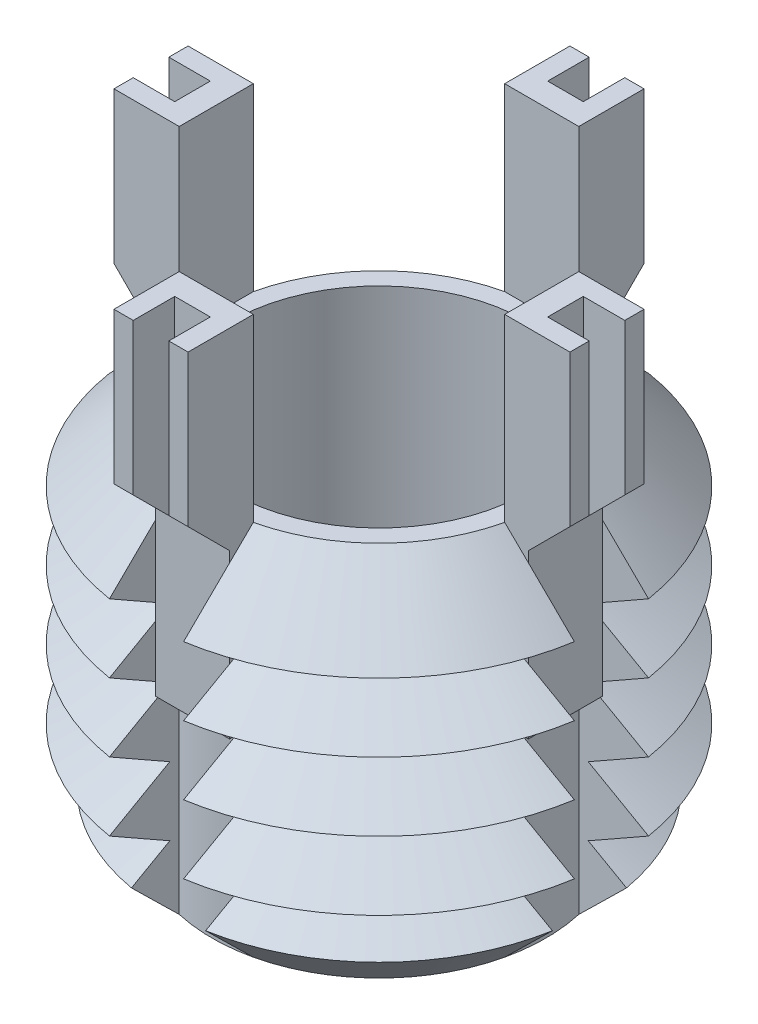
from build123d import *

# Parameters (mm, degrees)
SKETCH1_R           = 7.9375
BOSS_EXTRUDE1_DEPTH = 12.7
CHAMFER1_SIZE       = 2.309
LPATTERN1_COUNT     = 4
LPATTERN1_PITCH     = 2.309
CUT_EXTRUDE1_REACH  = 18.95
CIRPATTERN1_COUNT   = 4
BOSS_EXTRUDE3_DEPTH = 1.25
CIRPATTERN2_COUNT   = 4
CUT_EXTRUDE3_REACH  = 23.802
SKETCH6_W           = 1.4
SKETCH6_H           = 1.2
SKETCH6_W_2         = 1.2
SKETCH6_H_2         = 1.4
SKETCH7_R           = 5
CUT_EXTRUDE4_DEPTH  = 12.7


with BuildPart() as part:
    # Sketch1 → Boss-Extrude1 (new body)
    with BuildSketch(Plane(origin=(0, 0, 0), x_dir=(1, 0, 0), z_dir=(0, 1, 0))):
        with Locations(Location((0, 0, 0), (0, 0, 270))):
            Circle(SKETCH1_R)
    extrude(amount=-BOSS_EXTRUDE1_DEPTH)

    # Chamfer1
    chamfer1_edges = [part.edges().sort_by_distance(p)[0] for p in [
        (0, 0, -7.9375),
        (0, -12.7, -7.9375),
    ]]
    chamfer(chamfer1_edges, length=CHAMFER1_SIZE)

    # Sketch3 → Cut-Revolve1 (revolve, cut)
    with BuildSketch(Plane(origin=(0, 0, 0), x_dir=(0, 0, -1), z_dir=(1, 0, 0))):
        Polygon((-7.9375, -2.309), (-5.937847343, -3.4635), (-7.9375, -4.618), align=None)
    cut_revolve1 = revolve(axis=Axis((0, 0.885892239, 0), (0, -1, 0)), mode=Mode.SUBTRACT)

    # LPattern1: Cut-Revolve1 ×4
    with Locations(*[(0, -i * LPATTERN1_PITCH, 0) for i in range(1, LPATTERN1_COUNT)]):
        add(cut_revolve1, mode=Mode.SUBTRACT)

    # Cut-Extrude1: up to this cone (the profile starts inside it)
    cut_extrude1_end = Plane(origin=(0, 0, 0), z_dir=(0, 1, 0)).offset(-18.328499) * Cone(1e-06, 56.107, 56.106999, align=(Align.CENTER, Align.CENTER, Align.MIN), mode=Mode.PRIVATE)
    # Sketch4 → Cut-Extrude1 (cut, up to the surface)
    with BuildSketch(Plane(origin=(0, 0, 0), x_dir=(1, 0, 0), z_dir=(0, 1, 0)), mode=Mode.PRIVATE) as cut_extrude1_sk1:
        with BuildLine():
            Line((-5.487942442, 1.25), (-7.838456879, 1.25))
            ThreePointArc((-7.838456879, 1.25), (-7.9375, 0), (-7.838456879, -1.25))
            Line((-7.838456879, -1.25), (-5.487942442, -1.25))
            ThreePointArc((-5.487942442, -1.25), (-5.6285, 0), (-5.487942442, 1.25))
        make_face()
    cut_extrude1_tool1 = extrude(cut_extrude1_sk1.sketch, amount=-CUT_EXTRUDE1_REACH, mode=Mode.PRIVATE) & cut_extrude1_end
    cut_extrude1 = cut_extrude1_tool1.solids().sort_by_distance((-6.743037, 0, 0))[0]
    add(cut_extrude1, mode=Mode.SUBTRACT)

    # CirPattern1: Cut-Extrude1 ×4 about axis
    cirpattern1_axis = Axis((0, 0, 0), (0, 1, 0))
    for i in range(1, CIRPATTERN1_COUNT):
        add(cut_extrude1.rotate(cirpattern1_axis, i * 360 / CIRPATTERN1_COUNT), mode=Mode.SUBTRACT)

    # Sketch5 → Boss-Extrude3 (add, symmetric)
    with BuildSketch(Plane(origin=(0, 0, 0), x_dir=(0, 0, -1), z_dir=(1, 0, 0))):
        Polygon((-5.487942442, 6.073), (-5.487942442, -5.927), (-6.287942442, -5.927), (-6.287942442, -0.427), (-7.687942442, 0.973), (-7.687942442, 6.073), align=None)
    boss_extrude3 = extrude(amount=BOSS_EXTRUDE3_DEPTH, both=True)

    # CirPattern2: Boss-Extrude3 ×4 about axis
    cirpattern2_axis = Axis((0, 0, 0), (0, 1, 0))
    for i in range(1, CIRPATTERN2_COUNT):
        add(boss_extrude3.rotate(cirpattern2_axis, i * 360 / CIRPATTERN2_COUNT))

    # Cut-Extrude3: up to this plane
    cut_extrude3_end = Plane(origin=(-6.287942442, -0.427, 1.25), z_dir=(0.7071067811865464, 0.7071067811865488, -7.406550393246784e-15))
    # Sketch6 → Cut-Extrude3 (cut, up to the surface)
    with BuildSketch(Plane(origin=(0, 6.073, 0), x_dir=(1, 0, 0), z_dir=(0, 1, 0)), mode=Mode.PRIVATE) as cut_extrude3_sk1:
        with Locations((-6.987942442, 0)):
            Rectangle(SKETCH6_W, SKETCH6_H)
    cut_extrude3_tool1 = split(extrude(cut_extrude3_sk1.sketch, amount=-CUT_EXTRUDE3_REACH, mode=Mode.PRIVATE), bisect_by=cut_extrude3_end, keep=Keep.BOTH, mode=Mode.PRIVATE)
    add(cut_extrude3_tool1.solids().sort_by_distance((-6.987942, 6.073, 0))[0], mode=Mode.SUBTRACT)
    # Sketch6 → Cut-Extrude3 (cut, up to the surface)
    with BuildSketch(Plane(origin=(0, 6.073, 0), x_dir=(1, 0, 0), z_dir=(0, 1, 0)), mode=Mode.PRIVATE) as cut_extrude3_sk2:
        with Locations((0, 6.987942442)):
            Rectangle(SKETCH6_W_2, SKETCH6_H_2)
    cut_extrude3_tool2 = split(extrude(cut_extrude3_sk2.sketch, amount=-CUT_EXTRUDE3_REACH, mode=Mode.PRIVATE), bisect_by=cut_extrude3_end, keep=Keep.BOTH, mode=Mode.PRIVATE)
    add(cut_extrude3_tool2.solids().sort_by_distance((0, 6.073, -6.987942))[0], mode=Mode.SUBTRACT)
    # Sketch6 → Cut-Extrude3 (cut, up to the surface)
    with BuildSketch(Plane(origin=(0, 6.073, 0), x_dir=(1, 0, 0), z_dir=(0, 1, 0)), mode=Mode.PRIVATE) as cut_extrude3_sk3:
        with Locations((6.987942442, 0)):
            Rectangle(SKETCH6_W, SKETCH6_H)
    cut_extrude3_tool3 = split(extrude(cut_extrude3_sk3.sketch, amount=-CUT_EXTRUDE3_REACH, mode=Mode.PRIVATE), bisect_by=cut_extrude3_end, keep=Keep.BOTH, mode=Mode.PRIVATE)
    add(cut_extrude3_tool3.solids().sort_by_distance((6.987942, 6.073, 0))[0], mode=Mode.SUBTRACT)
    # Sketch6 → Cut-Extrude3 (cut, up to the surface)
    with BuildSketch(Plane(origin=(0, 6.073, 0), x_dir=(1, 0, 0), z_dir=(0, 1, 0)), mode=Mode.PRIVATE) as cut_extrude3_sk4:
        with Locations((0, -6.987942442)):
            Rectangle(SKETCH6_W_2, SKETCH6_H_2)
    cut_extrude3_tool4 = split(extrude(cut_extrude3_sk4.sketch, amount=-CUT_EXTRUDE3_REACH, mode=Mode.PRIVATE), bisect_by=cut_extrude3_end, keep=Keep.BOTH, mode=Mode.PRIVATE)
    add(cut_extrude3_tool4.solids().sort_by_distance((0, 6.073, 6.987942))[0], mode=Mode.SUBTRACT)

    # Sketch7 → Cut-Extrude4 (cut)
    with BuildSketch(Plane(origin=(0, 0, 0), x_dir=(1, 0, 0), z_dir=(0, 1, 0))):
        with Locations(Location((0, 0, 0), (0, 0, 270))):
            Circle(SKETCH7_R)
    extrude(amount=-CUT_EXTRUDE4_DEPTH, mode=Mode.SUBTRACT)


solid = part.part
